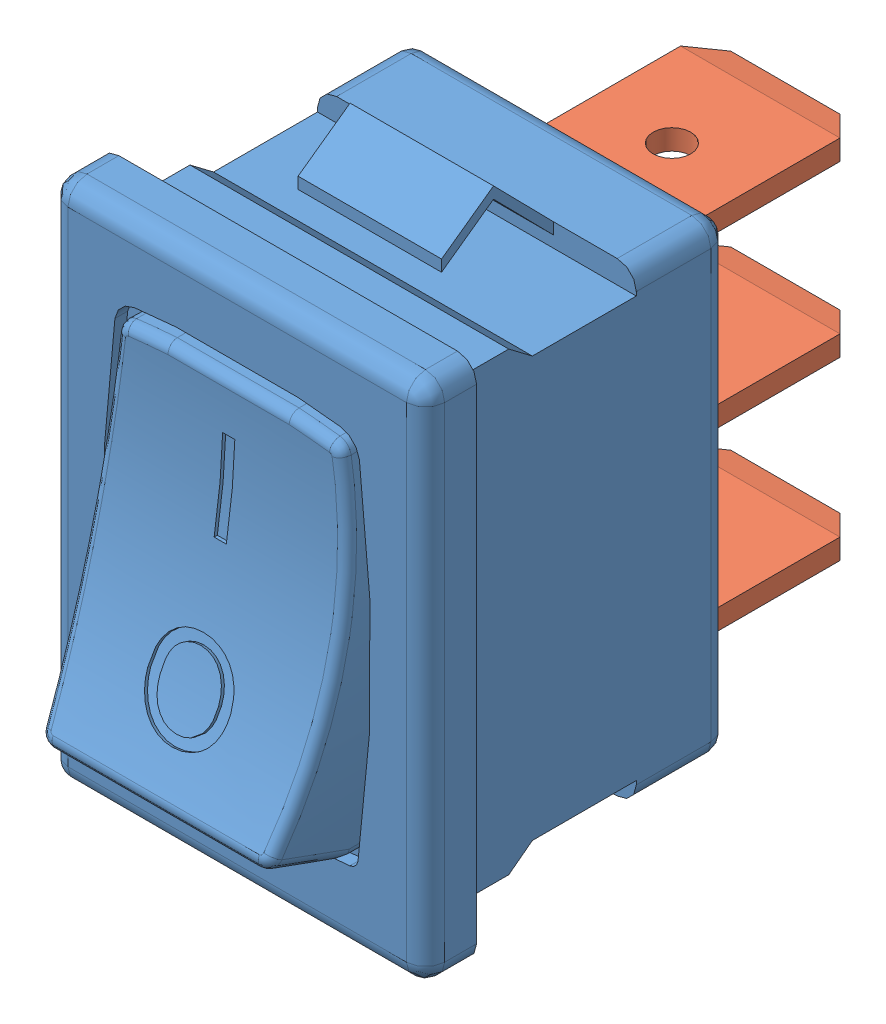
SolidWorks assembly SWITCH.SLDASM, configuration Default (file format 13000). Lengths in mm.
Overall size (15.01 23.42 25.66).
4 component instances, 2 part files, 9 mates.
Components (placement in the parent):
- SWITCH-3 PRONGS-1: SWITCH-3 PRONGS.SLDPRT [Default] at origin size (15.01 23.42 17.74)
- Slide_Clip_Male-1: Slide_Clip_Male.SLDPRT [Default] at (-4.318 -6.556 -16.6842) x (-1 0 0) z (0 0 -1) size (7.92 0.81 14.02)
- Slide_Clip_Male-2: Slide_Clip_Male.SLDPRT [Default] at (-4.318 0.4544 -16.6842) x (-1 0 0) z (0 0 -1) size (7.92 0.81 14.02)
- Slide_Clip_Male-4: Slide_Clip_Male.SLDPRT [Default] at (-4.318 7.2108 -16.6842) x (-1 0 0) z (0 0 -1) size (7.92 0.81 14.02)
Mates (geometry in assembly coordinates):
- Coincident1: coincident anti-aligned: plane of SWITCH-3 PRONGS-1 through (-8.763 -7.366 -13.0302) normal (0 1 0); plane of Slide_Clip_Male-1 through (-1.6434 -7.366 -7.4342) normal (0 -1 0)
- Coincident2: coincident anti-aligned: plane of SWITCH-3 PRONGS-1 through (-1.143 -6.4008 -13.0302) normal (-1 0 0); plane of Slide_Clip_Male-1 through (-1.143 -7.366 -21.2042) normal (1 0 0)
- Coincident4: coincident aligned: plane of SWITCH-3 PRONGS-1 through (1.397 -9.271 -13.2842) normal (0 0 -1); plane of Slide_Clip_Male-1 through (-1.143 -7.366 -13.2842) normal (0 0 -1)
- Coincident5: coincident anti-aligned: plane of SWITCH-3 PRONGS-1 through (-8.763 -0.3556 -13.0302) normal (0 1 0); plane of Slide_Clip_Male-2 through (-1.6434 -0.3556 -7.4342) normal (0 -1 0)
- Coincident6: coincident aligned: plane of Slide_Clip_Male-1 through (-1.143 -7.366 -21.2042) normal (0 0 -1); plane of Slide_Clip_Male-2 through (-1.143 -0.3556 -21.2042) normal (0 0 -1)
- Coincident7: coincident aligned: plane of Slide_Clip_Male-1 through (-1.143 -7.366 -21.2042) normal (1 0 0); plane of Slide_Clip_Male-2 through (-1.143 -0.3556 -21.2042) normal (1 0 0)
- Coincident8: coincident anti-aligned: plane of SWITCH-3 PRONGS-1 through (-8.763 6.4008 -13.0302) normal (0 1 0); plane of Slide_Clip_Male-4 through (-1.6434 6.4008 -7.4342) normal (0 -1 0)
- Coincident9: coincident aligned: plane of Slide_Clip_Male-2 through (-1.143 -0.3556 -21.2042) normal (1 0 0); plane of Slide_Clip_Male-4 through (-1.143 6.4008 -21.2042) normal (1 0 0)
- Coincident10: coincident aligned: plane of Slide_Clip_Male-2 through (-1.143 -0.3556 -21.2042) normal (0 0 -1); plane of Slide_Clip_Male-4 through (-1.143 6.4008 -21.2042) normal (0 0 -1)
